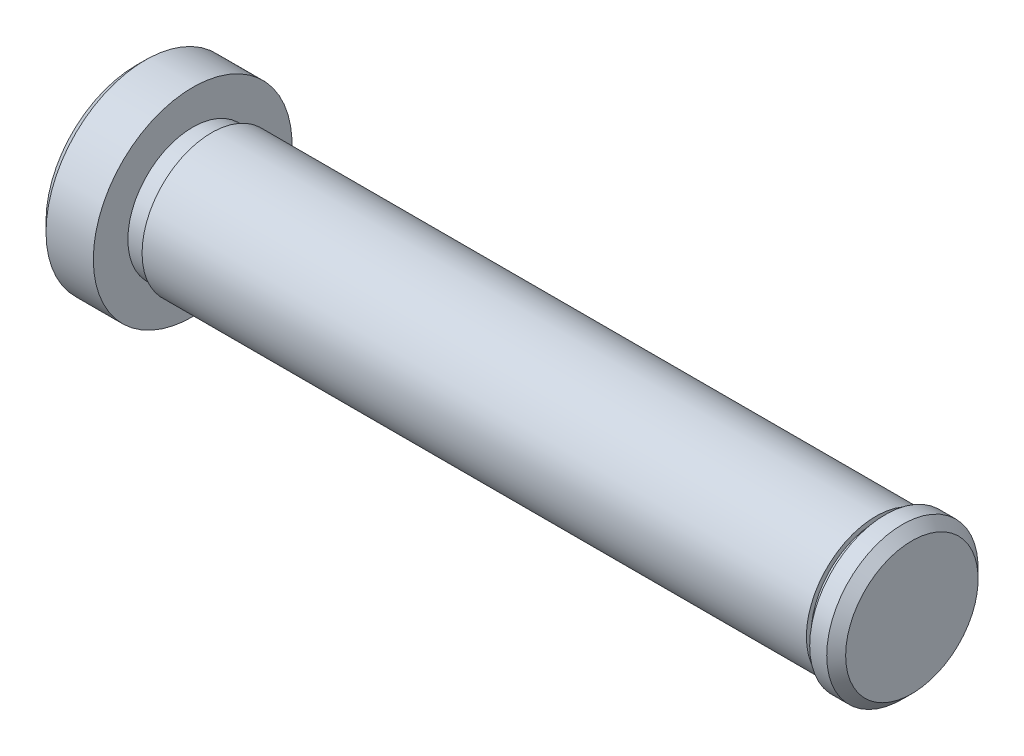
from build123d import *

# Parameters (mm, degrees)
SKETCH_1_W     = 1
SKETCH_1_H     = 6.85
SKETCH_1_W_2   = 2
SKETCH_1_W_3   = 6
SKETCH_1_H_2   = 10.5
CHAMFER_1_SIZE = 1


with BuildPart() as part:
    # Sketch 1 → Revolve 1 (revolve)
    with BuildSketch(Plane.XY, mode=Mode.PRIVATE) as revolve_1_sk:
        Polygon((79.2, 6.85), (79.2, 0), (82, 0), (82, 8), (79.2, 8), align=None)
        with Locations((78.7, 3.425)):
            Rectangle(SKETCH_1_W, SKETCH_1_H)
        Polygon((8, 6.85), (8, 0), (78.2, 0), (78.2, 6.85), (78.2, 7.35), (8, 7.35), align=None)
        with Locations((7, 3.425)):
            Rectangle(SKETCH_1_W_2, SKETCH_1_H)
        with Locations((3, 5.25)):
            Rectangle(SKETCH_1_W_3, SKETCH_1_H_2)
    revolve(revolve_1_sk.sketch.rotate(Axis((8, 0, 0), (1, 0, 0)), 90), axis=Axis((8, 0, 0), (1, 0, 0)))

    # Chamfer 1
    chamfer_1_edges = [part.edges().sort_by_distance(p)[0] for p in [
        (0, 0, -10.5),
        (82, 0, -8),
    ]]
    chamfer(chamfer_1_edges, length=CHAMFER_1_SIZE)


solid = part.part
